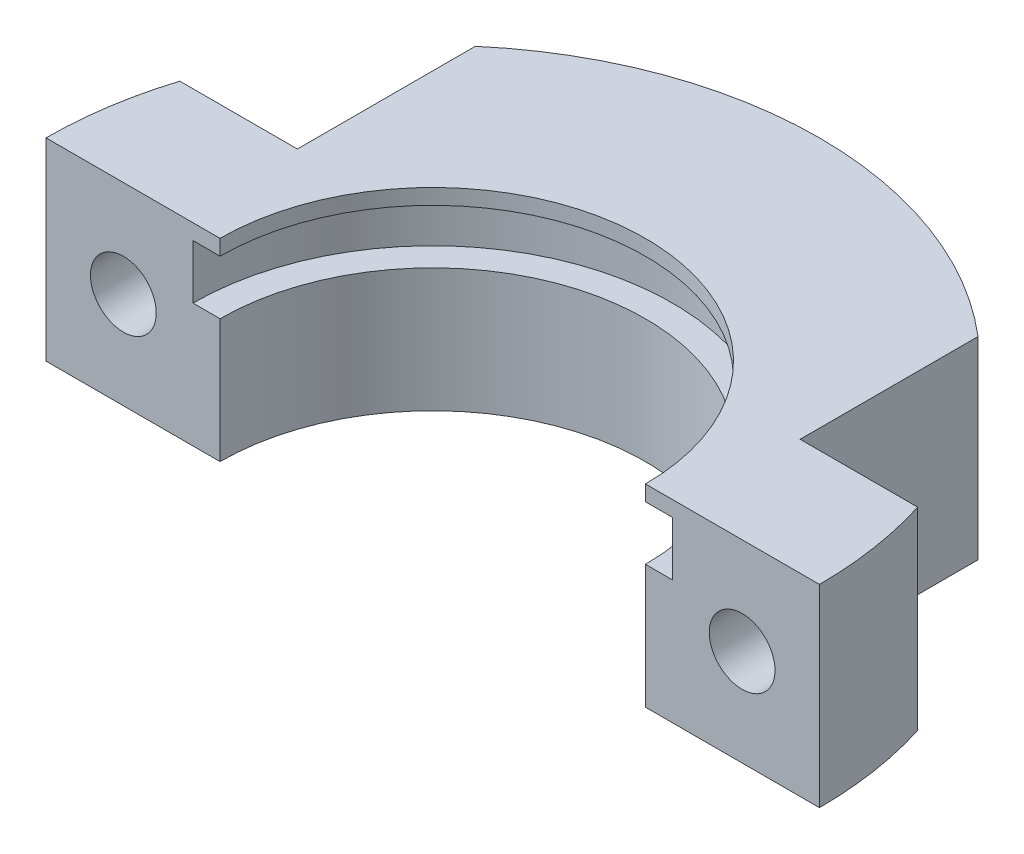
from build123d import *

# Parameters (mm, degrees)
EXTRUDE1_DEPTH     = 50
SKETCH2_W          = 30.085488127
SKETCH2_H          = 14
CUT_EXTRUDE1_REACH = 152
SKETCH3_W          = 43.043175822
SKETCH3_H          = 72.811705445
CUT_EXTRUDE2_REACH = 133.909
SKETCH4_R          = 8.5


with BuildPart() as part:
    # Sketch1 → Extrude1 (new body)
    with BuildSketch(Plane(origin=(0, 0, 0), x_dir=(1, 0, 0), z_dir=(0, 1, 0))):
        with BuildLine():
            Line((55, 0), (100, 0))
            ThreePointArc((100, 0), (0, 100), (-100, 0))
            Line((-100, 0), (-55, 0))
            ThreePointArc((-55, 0), (0, 55), (55, 0))
        make_face()
    extrude(amount=EXTRUDE1_DEPTH)

    # Sketch2 → Cut-Revolve1 (revolve, cut)
    with BuildSketch(Plane(origin=(0, 0, 0), x_dir=(0, 0, -1), z_dir=(1, 0, 0))):
        with Locations((46.957255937, 39)):
            Rectangle(SKETCH2_W, SKETCH2_H)
    revolve(axis=Axis((0, 71.270664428, 0), (0, -1, 0)), mode=Mode.SUBTRACT)

    # Sketch3 → Cut-Extrude1 (cut, up to next)
    with BuildSketch(Plane(origin=(0, 50, 0), x_dir=(1, 0, 0), z_dir=(0, 1, 0)), mode=Mode.PRIVATE) as cut_extrude1_sk1:
        with Locations((86.521587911, 66.405852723)):
            Rectangle(SKETCH3_W, SKETCH3_H)
    cut_extrude1_tool1 = extrude(cut_extrude1_sk1.sketch, amount=-CUT_EXTRUDE1_REACH, mode=Mode.PRIVATE) & part.part
    cut_extrude1 = cut_extrude1_tool1.solids().sort_by_distance((86.521588, 50, -66.405853))[0]
    add(cut_extrude1, mode=Mode.SUBTRACT)

    # Mirror1: Cut-Extrude1 across plane
    add(cut_extrude1.mirror(Plane(origin=(0, 0, 0), x_dir=(0, 0, 1), z_dir=(1, 0, 0))), mode=Mode.SUBTRACT)

    # Sketch4 → Cut-Extrude2 (cut, up to next)
    with BuildSketch(Plane(origin=(0, 0, -30), x_dir=(-1, 0, 0), z_dir=(0, 0, -1)), mode=Mode.PRIVATE) as cut_extrude2_sk1:
        with Locations((80, 25)):
            Circle(SKETCH4_R)
    cut_extrude2_tool1 = extrude(cut_extrude2_sk1.sketch, amount=-CUT_EXTRUDE2_REACH, mode=Mode.PRIVATE) & part.part
    # Sketch4 → Cut-Extrude2 (cut, up to next)
    with BuildSketch(Plane(origin=(0, 0, -30), x_dir=(-1, 0, 0), z_dir=(0, 0, -1)), mode=Mode.PRIVATE) as cut_extrude2_sk2:
        with Locations(Location((-80, 25, 0), (0, 0, 180))):
            Circle(SKETCH4_R)
    cut_extrude2_tool2 = extrude(cut_extrude2_sk2.sketch, amount=-CUT_EXTRUDE2_REACH, mode=Mode.PRIVATE) & part.part
    add(cut_extrude2_tool1.solids().sort_by_distance((-80, 25, -30))[0], mode=Mode.SUBTRACT)
    add(cut_extrude2_tool2.solids().sort_by_distance((80, 25, -30))[0], mode=Mode.SUBTRACT)


solid = part.part
